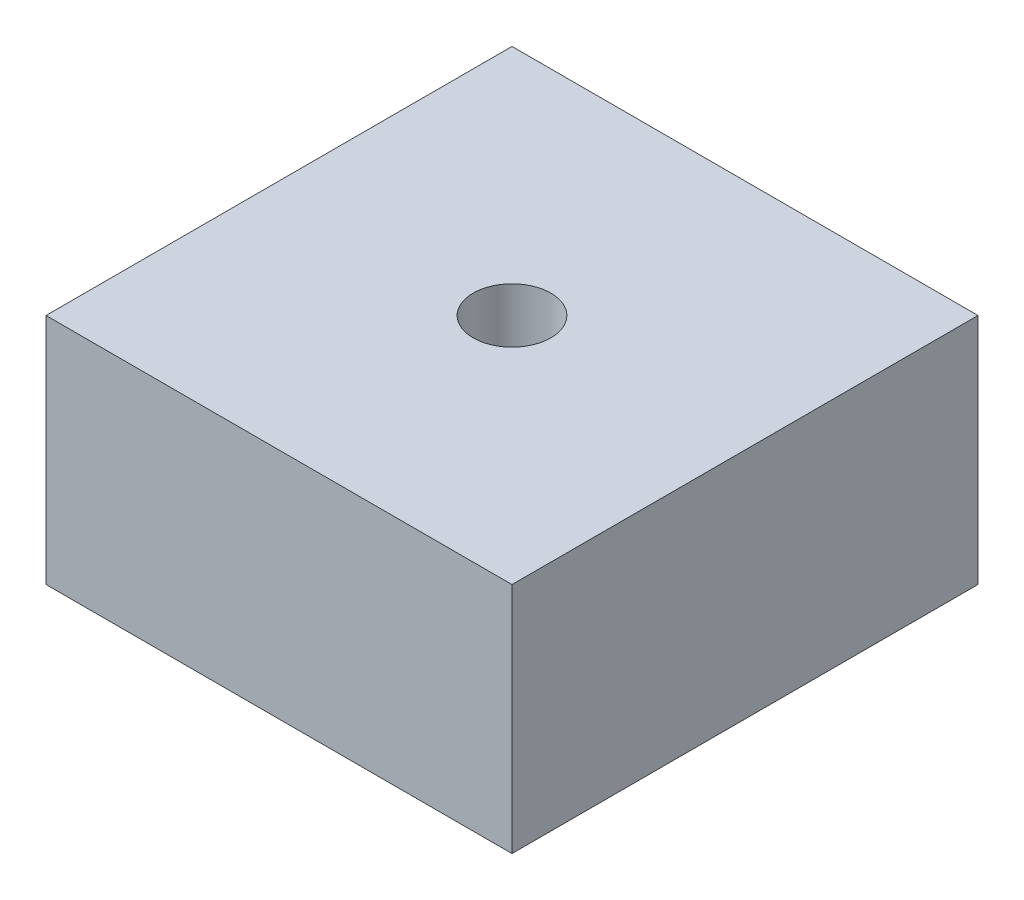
from build123d import *

# Parameters (mm, degrees)
SKETCH1_W           = 38.1
SKETCH1_H           = 38.1
BOSS_EXTRUDE1_DEPTH = 19.05
SKETCH2_R           = 3.175
CUT_EXTRUDE1_DEPTH  = 33.995567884


with BuildPart() as part:
    # Sketch1 → Boss-Extrude1 (new body)
    with BuildSketch(Plane(origin=(0, 0, 0), x_dir=(1, 0, 0), z_dir=(0, 1, 0))):
        Rectangle(SKETCH1_W, SKETCH1_H)
    extrude(amount=BOSS_EXTRUDE1_DEPTH)

    # Sketch2 → Cut-Extrude1 (cut, through all)
    with BuildSketch(Plane(origin=(0, 19.05, 0), x_dir=(1, 0, 0), z_dir=(0, 1, 0))):
        with Locations(Location((0, 0, 0), (0, 0, 270))):
            Circle(SKETCH2_R)
    extrude(amount=-CUT_EXTRUDE1_DEPTH, mode=Mode.SUBTRACT)


solid = part.part
